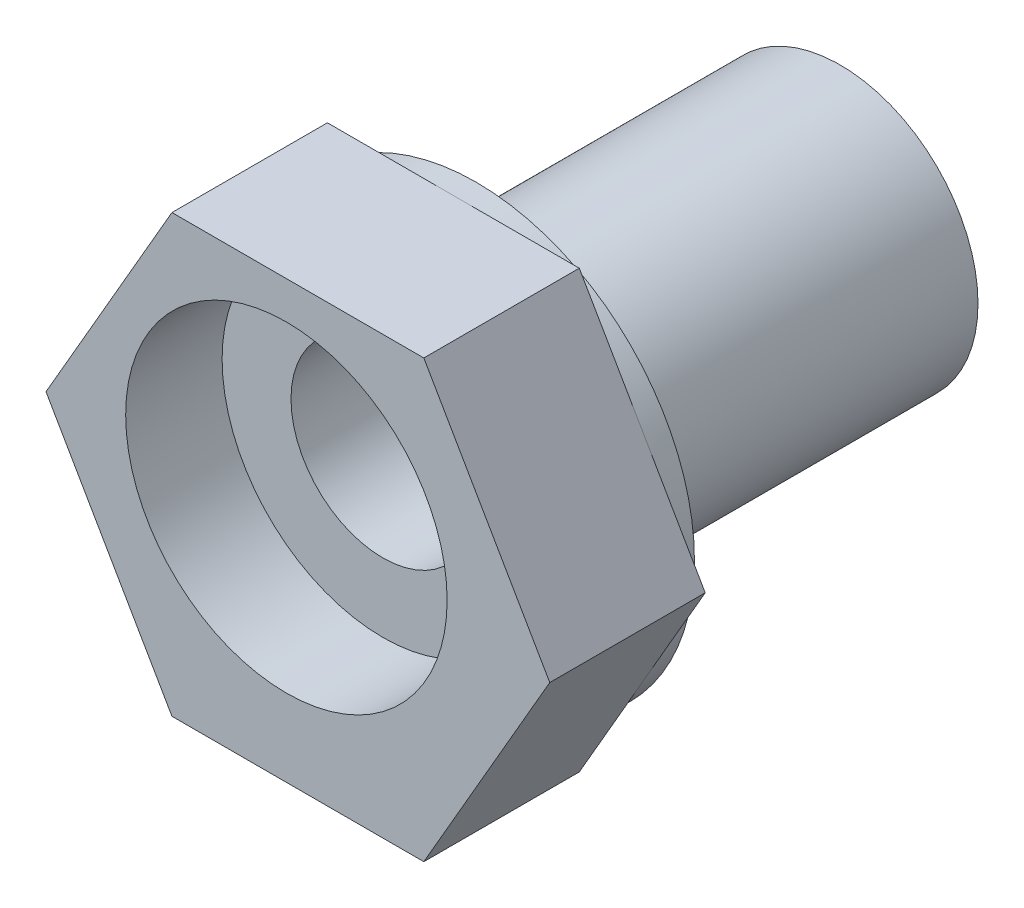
ISO-10303-21;
HEADER;
FILE_DESCRIPTION(('STEP AP214'),'2;1');
FILE_NAME('part.step','',(''),(''),'','','');
FILE_SCHEMA(('AUTOMOTIVE_DESIGN { 1 0 10303 214 1 1 1 1 }'));
ENDSEC;
DATA;
#1=APPLICATION_CONTEXT('core data for automotive mechanical design processes');
#2=APPLICATION_PROTOCOL_DEFINITION('international standard','automotive_design',2000,#1);
#3=PRODUCT_CONTEXT('',#1,'mechanical');
#4=PRODUCT('Part','Part','',(#3));
#5=PRODUCT_RELATED_PRODUCT_CATEGORY('part','',(#4));
#6=PRODUCT_DEFINITION_FORMATION('','',#4);
#7=PRODUCT_DEFINITION_CONTEXT('part definition',#1,'design');
#8=PRODUCT_DEFINITION('design','',#6,#7);
#9=PRODUCT_DEFINITION_SHAPE('','',#8);
#10=(LENGTH_UNIT() NAMED_UNIT(*) SI_UNIT(.MILLI.,.METRE.));
#11=(NAMED_UNIT(*) PLANE_ANGLE_UNIT() SI_UNIT($,.RADIAN.));
#12=(NAMED_UNIT(*) SI_UNIT($,.STERADIAN.) SOLID_ANGLE_UNIT());
#13=UNCERTAINTY_MEASURE_WITH_UNIT(LENGTH_MEASURE(1.E-05),#10,'distance_accuracy_value','');
#14=(GEOMETRIC_REPRESENTATION_CONTEXT(3) GLOBAL_UNCERTAINTY_ASSIGNED_CONTEXT((#13)) GLOBAL_UNIT_ASSIGNED_CONTEXT((#10,
#11,#12)) REPRESENTATION_CONTEXT('',''));
#15=CARTESIAN_POINT('',(0.,0.,0.));
#16=DIRECTION('',(0.,0.,1.));
#17=DIRECTION('',(1.,0.,0.));
#18=AXIS2_PLACEMENT_3D('',#15,#16,#17);
#19=CARTESIAN_POINT('',(0.,0.,23.62));
#20=DIRECTION('',(0.,0.,1.));
#21=DIRECTION('',(1.,0.,0.));
#22=AXIS2_PLACEMENT_3D('',#19,#20,#21);
#23=PLANE('',#22);
#24=CARTESIAN_POINT('',(-0.499999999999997,0.866025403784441,23.62));
#25=DIRECTION('',(0.,0.,-1.));
#26=DIRECTION('',(0.,1.,0.));
#27=AXIS2_PLACEMENT_3D('',#24,#25,#26);
#28=CIRCLE('',#27,7.);
#29=CARTESIAN_POINT('',(-0.499999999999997,7.86602540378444,23.62));
#30=VERTEX_POINT('',#29);
#31=EDGE_CURVE('E20',#30,#30,#28,.T.);
#32=ORIENTED_EDGE('',*,*,#31,.T.);
#33=EDGE_LOOP('',(#32));
#34=FACE_BOUND('',#33,.T.);
#35=DIRECTION('',(1.,0.,0.));
#36=VECTOR('',#35,1.);
#37=CARTESIAN_POINT('',(5.48482755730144,-9.5,23.62));
#38=LINE('',#37,#36);
#39=CARTESIAN_POINT('',(5.48482755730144,-9.5,23.62));
#40=VERTEX_POINT('',#39);
#41=CARTESIAN_POINT('',(-5.48482755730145,-9.5,23.62));
#42=VERTEX_POINT('',#41);
#43=EDGE_CURVE('E94',#40,#42,#38,.F.);
#44=ORIENTED_EDGE('',*,*,#43,.F.);
#45=DIRECTION('',(0.5,0.866025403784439,0.));
#46=VECTOR('',#45,1.);
#47=CARTESIAN_POINT('',(10.9696551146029,0.,23.62));
#48=LINE('',#47,#46);
#49=CARTESIAN_POINT('',(10.9696551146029,0.,23.62));
#50=VERTEX_POINT('',#49);
#51=EDGE_CURVE('E96',#50,#40,#48,.F.);
#52=ORIENTED_EDGE('',*,*,#51,.F.);
#53=DIRECTION('',(-0.499999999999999,0.866025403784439,0.));
#54=VECTOR('',#53,1.);
#55=CARTESIAN_POINT('',(5.48482755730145,9.5,23.62));
#56=LINE('',#55,#54);
#57=CARTESIAN_POINT('',(5.48482755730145,9.5,23.62));
#58=VERTEX_POINT('',#57);
#59=EDGE_CURVE('E123',#58,#50,#56,.F.);
#60=ORIENTED_EDGE('',*,*,#59,.F.);
#61=DIRECTION('',(1.,0.,0.));
#62=VECTOR('',#61,1.);
#63=CARTESIAN_POINT('',(-5.48482755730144,9.5,23.62));
#64=LINE('',#63,#62);
#65=CARTESIAN_POINT('',(-5.48482755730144,9.5,23.62));
#66=VERTEX_POINT('',#65);
#67=EDGE_CURVE('E122',#66,#58,#64,.T.);
#68=ORIENTED_EDGE('',*,*,#67,.F.);
#69=DIRECTION('',(-0.5,-0.866025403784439,0.));
#70=VECTOR('',#69,1.);
#71=CARTESIAN_POINT('',(-10.9696551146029,0.,23.62));
#72=LINE('',#71,#70);
#73=CARTESIAN_POINT('',(-10.9696551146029,0.,23.62));
#74=VERTEX_POINT('',#73);
#75=EDGE_CURVE('E124',#74,#66,#72,.F.);
#76=ORIENTED_EDGE('',*,*,#75,.F.);
#77=DIRECTION('',(0.5,-0.866025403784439,0.));
#78=VECTOR('',#77,1.);
#79=CARTESIAN_POINT('',(-5.48482755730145,-9.5,23.62));
#80=LINE('',#79,#78);
#81=EDGE_CURVE('E99',#42,#74,#80,.F.);
#82=ORIENTED_EDGE('',*,*,#81,.F.);
#83=EDGE_LOOP('',(#44,#52,#60,#68,#76,#82));
#84=FACE_BOUND('',#83,.T.);
#85=ADVANCED_FACE('F16',(#34,#84),#23,.T.);
#86=CARTESIAN_POINT('',(10.9696551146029,0.,16.85));
#87=DIRECTION('',(0.866025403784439,-0.5,0.));
#88=DIRECTION('',(0.5,0.866025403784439,0.));
#89=AXIS2_PLACEMENT_3D('',#86,#87,#88);
#90=PLANE('',#89);
#91=DIRECTION('',(0.5,0.866025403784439,0.));
#92=VECTOR('',#91,1.);
#93=CARTESIAN_POINT('',(8.22724133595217,-4.75,16.85));
#94=LINE('',#93,#92);
#95=CARTESIAN_POINT('',(8.22724133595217,-4.75,16.85));
#96=VERTEX_POINT('',#95);
#97=CARTESIAN_POINT('',(10.9696551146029,0.,16.85));
#98=VERTEX_POINT('',#97);
#99=EDGE_CURVE('E185',#96,#98,#94,.T.);
#100=ORIENTED_EDGE('',*,*,#99,.T.);
#101=DIRECTION('',(0.,0.,1.));
#102=VECTOR('',#101,1.);
#103=CARTESIAN_POINT('',(10.9696551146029,0.,16.85));
#104=LINE('',#103,#102);
#105=EDGE_CURVE('E108',#50,#98,#104,.F.);
#106=ORIENTED_EDGE('',*,*,#105,.F.);
#107=ORIENTED_EDGE('',*,*,#51,.T.);
#108=DIRECTION('',(0.,0.,-1.));
#109=VECTOR('',#108,1.);
#110=CARTESIAN_POINT('',(5.48482755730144,-9.5,16.85));
#111=LINE('',#110,#109);
#112=CARTESIAN_POINT('',(5.48482755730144,-9.5,16.85));
#113=VERTEX_POINT('',#112);
#114=EDGE_CURVE('E103',#113,#40,#111,.F.);
#115=ORIENTED_EDGE('',*,*,#114,.F.);
#116=DIRECTION('',(0.5,0.866025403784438,0.));
#117=VECTOR('',#116,1.);
#118=CARTESIAN_POINT('',(5.48482755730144,-9.5,16.85));
#119=LINE('',#118,#117);
#120=EDGE_CURVE('E181',#113,#96,#119,.T.);
#121=ORIENTED_EDGE('',*,*,#120,.T.);
#122=EDGE_LOOP('',(#100,#106,#107,#115,#121));
#123=FACE_BOUND('',#122,.T.);
#124=ADVANCED_FACE('F106',(#123),#90,.T.);
#125=CARTESIAN_POINT('',(5.48482755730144,-9.5,16.85));
#126=DIRECTION('',(0.,-1.,0.));
#127=DIRECTION('',(0.,0.,-1.));
#128=AXIS2_PLACEMENT_3D('',#125,#126,#127);
#129=PLANE('',#128);
#130=DIRECTION('',(1.,0.,0.));
#131=VECTOR('',#130,1.);
#132=CARTESIAN_POINT('',(0.,-9.5,16.85));
#133=LINE('',#132,#131);
#134=CARTESIAN_POINT('',(0.,-9.5,16.85));
#135=VERTEX_POINT('',#134);
#136=EDGE_CURVE('E113',#135,#113,#133,.T.);
#137=ORIENTED_EDGE('',*,*,#136,.T.);
#138=ORIENTED_EDGE('',*,*,#114,.T.);
#139=ORIENTED_EDGE('',*,*,#43,.T.);
#140=DIRECTION('',(0.,0.,1.));
#141=VECTOR('',#140,1.);
#142=CARTESIAN_POINT('',(-5.48482755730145,-9.5,16.85));
#143=LINE('',#142,#141);
#144=CARTESIAN_POINT('',(-5.48482755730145,-9.5,16.85));
#145=VERTEX_POINT('',#144);
#146=EDGE_CURVE('E116',#145,#42,#143,.T.);
#147=ORIENTED_EDGE('',*,*,#146,.F.);
#148=DIRECTION('',(1.,0.,0.));
#149=VECTOR('',#148,1.);
#150=CARTESIAN_POINT('',(0.,-9.5,16.85));
#151=LINE('',#150,#149);
#152=EDGE_CURVE('E176',#145,#135,#151,.T.);
#153=ORIENTED_EDGE('',*,*,#152,.T.);
#154=EDGE_LOOP('',(#137,#138,#139,#147,#153));
#155=FACE_BOUND('',#154,.T.);
#156=ADVANCED_FACE('F111',(#155),#129,.T.);
#157=CARTESIAN_POINT('',(-5.48482755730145,-9.5,16.85));
#158=DIRECTION('',(-0.866025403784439,-0.5,0.));
#159=DIRECTION('',(0.5,-0.866025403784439,0.));
#160=AXIS2_PLACEMENT_3D('',#157,#158,#159);
#161=PLANE('',#160);
#162=DIRECTION('',(0.5,-0.866025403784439,0.));
#163=VECTOR('',#162,1.);
#164=CARTESIAN_POINT('',(-8.22724133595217,-4.75,16.85));
#165=LINE('',#164,#163);
#166=CARTESIAN_POINT('',(-8.22724133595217,-4.74999999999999,16.85));
#167=VERTEX_POINT('',#166);
#168=EDGE_CURVE('E178',#167,#145,#165,.T.);
#169=ORIENTED_EDGE('',*,*,#168,.T.);
#170=ORIENTED_EDGE('',*,*,#146,.T.);
#171=ORIENTED_EDGE('',*,*,#81,.T.);
#172=DIRECTION('',(0.,0.,1.));
#173=VECTOR('',#172,1.);
#174=CARTESIAN_POINT('',(-10.9696551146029,0.,16.85));
#175=LINE('',#174,#173);
#176=CARTESIAN_POINT('',(-10.9696551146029,0.,16.85));
#177=VERTEX_POINT('',#176);
#178=EDGE_CURVE('E127',#177,#74,#175,.T.);
#179=ORIENTED_EDGE('',*,*,#178,.F.);
#180=DIRECTION('',(0.5,-0.866025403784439,0.));
#181=VECTOR('',#180,1.);
#182=CARTESIAN_POINT('',(-10.9696551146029,0.,16.85));
#183=LINE('',#182,#181);
#184=EDGE_CURVE('E171',#177,#167,#183,.T.);
#185=ORIENTED_EDGE('',*,*,#184,.T.);
#186=EDGE_LOOP('',(#169,#170,#171,#179,#185));
#187=FACE_BOUND('',#186,.T.);
#188=ADVANCED_FACE('F196',(#187),#161,.T.);
#189=CARTESIAN_POINT('',(-10.9696551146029,0.,16.85));
#190=DIRECTION('',(-0.866025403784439,0.5,0.));
#191=DIRECTION('',(-0.5,-0.866025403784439,0.));
#192=AXIS2_PLACEMENT_3D('',#189,#190,#191);
#193=PLANE('',#192);
#194=DIRECTION('',(-0.5,-0.866025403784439,0.));
#195=VECTOR('',#194,1.);
#196=CARTESIAN_POINT('',(-8.22724133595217,4.75,16.85));
#197=LINE('',#196,#195);
#198=CARTESIAN_POINT('',(-8.22724133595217,4.75,16.85));
#199=VERTEX_POINT('',#198);
#200=EDGE_CURVE('E173',#199,#177,#197,.T.);
#201=ORIENTED_EDGE('',*,*,#200,.T.);
#202=ORIENTED_EDGE('',*,*,#178,.T.);
#203=ORIENTED_EDGE('',*,*,#75,.T.);
#204=DIRECTION('',(0.,0.,1.));
#205=VECTOR('',#204,1.);
#206=CARTESIAN_POINT('',(-5.48482755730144,9.5,16.85));
#207=LINE('',#206,#205);
#208=CARTESIAN_POINT('',(-5.48482755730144,9.5,16.85));
#209=VERTEX_POINT('',#208);
#210=EDGE_CURVE('E188',#209,#66,#207,.T.);
#211=ORIENTED_EDGE('',*,*,#210,.F.);
#212=DIRECTION('',(-0.5,-0.866025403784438,0.));
#213=VECTOR('',#212,1.);
#214=CARTESIAN_POINT('',(-5.48482755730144,9.5,16.85));
#215=LINE('',#214,#213);
#216=EDGE_CURVE('E165',#209,#199,#215,.T.);
#217=ORIENTED_EDGE('',*,*,#216,.T.);
#218=EDGE_LOOP('',(#201,#202,#203,#211,#217));
#219=FACE_BOUND('',#218,.T.);
#220=ADVANCED_FACE('F192',(#219),#193,.T.);
#221=CARTESIAN_POINT('',(5.48482755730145,9.5,16.85));
#222=DIRECTION('',(0.866025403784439,0.499999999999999,0.));
#223=DIRECTION('',(-0.499999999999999,0.866025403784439,0.));
#224=AXIS2_PLACEMENT_3D('',#221,#222,#223);
#225=PLANE('',#224);
#226=DIRECTION('',(-0.499999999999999,0.866025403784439,0.));
#227=VECTOR('',#226,1.);
#228=CARTESIAN_POINT('',(8.22724133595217,4.74999999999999,16.85));
#229=LINE('',#228,#227);
#230=CARTESIAN_POINT('',(8.22724133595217,4.74999999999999,16.85));
#231=VERTEX_POINT('',#230);
#232=CARTESIAN_POINT('',(5.48482755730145,9.5,16.85));
#233=VERTEX_POINT('',#232);
#234=EDGE_CURVE('E62',#231,#233,#229,.T.);
#235=ORIENTED_EDGE('',*,*,#234,.T.);
#236=DIRECTION('',(0.,0.,1.));
#237=VECTOR('',#236,1.);
#238=CARTESIAN_POINT('',(5.48482755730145,9.5,16.85));
#239=LINE('',#238,#237);
#240=EDGE_CURVE('E130',#58,#233,#239,.F.);
#241=ORIENTED_EDGE('',*,*,#240,.F.);
#242=ORIENTED_EDGE('',*,*,#59,.T.);
#243=ORIENTED_EDGE('',*,*,#105,.T.);
#244=DIRECTION('',(-0.5,0.866025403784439,0.));
#245=VECTOR('',#244,1.);
#246=CARTESIAN_POINT('',(10.9696551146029,0.,16.85));
#247=LINE('',#246,#245);
#248=EDGE_CURVE('E55',#98,#231,#247,.T.);
#249=ORIENTED_EDGE('',*,*,#248,.T.);
#250=EDGE_LOOP('',(#235,#241,#242,#243,#249));
#251=FACE_BOUND('',#250,.T.);
#252=ADVANCED_FACE('F323',(#251),#225,.T.);
#253=CARTESIAN_POINT('',(-5.48482755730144,9.5,16.85));
#254=DIRECTION('',(0.,1.,0.));
#255=DIRECTION('',(0.,0.,1.));
#256=AXIS2_PLACEMENT_3D('',#253,#254,#255);
#257=PLANE('',#256);
#258=DIRECTION('',(1.,0.,0.));
#259=VECTOR('',#258,1.);
#260=CARTESIAN_POINT('',(0.,9.5,16.85));
#261=LINE('',#260,#259);
#262=CARTESIAN_POINT('',(0.,9.5,16.85));
#263=VERTEX_POINT('',#262);
#264=EDGE_CURVE('E169',#263,#209,#261,.F.);
#265=ORIENTED_EDGE('',*,*,#264,.T.);
#266=ORIENTED_EDGE('',*,*,#210,.T.);
#267=ORIENTED_EDGE('',*,*,#67,.T.);
#268=ORIENTED_EDGE('',*,*,#240,.T.);
#269=DIRECTION('',(1.,0.,0.));
#270=VECTOR('',#269,1.);
#271=CARTESIAN_POINT('',(0.,9.5,16.85));
#272=LINE('',#271,#270);
#273=EDGE_CURVE('E35',#233,#263,#272,.F.);
#274=ORIENTED_EDGE('',*,*,#273,.T.);
#275=EDGE_LOOP('',(#265,#266,#267,#268,#274));
#276=FACE_BOUND('',#275,.T.);
#277=ADVANCED_FACE('F218',(#276),#257,.T.);
#278=CARTESIAN_POINT('',(-0.499999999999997,0.866025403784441,23.62));
#279=DIRECTION('',(0.,0.,-1.));
#280=DIRECTION('',(0.,1.,0.));
#281=AXIS2_PLACEMENT_3D('',#278,#279,#280);
#282=CYLINDRICAL_SURFACE('',#281,7.);
#283=CARTESIAN_POINT('',(-0.499999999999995,0.866025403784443,19.42));
#284=DIRECTION('',(0.,0.,-1.));
#285=DIRECTION('',(0.,1.,0.));
#286=AXIS2_PLACEMENT_3D('',#283,#284,#285);
#287=CIRCLE('',#286,7.);
#288=CARTESIAN_POINT('',(-0.499999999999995,7.86602540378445,19.42));
#289=VERTEX_POINT('',#288);
#290=EDGE_CURVE('E160',#289,#289,#287,.T.);
#291=ORIENTED_EDGE('',*,*,#290,.T.);
#292=EDGE_LOOP('',(#291));
#293=FACE_BOUND('',#292,.T.);
#294=ORIENTED_EDGE('',*,*,#31,.F.);
#295=EDGE_LOOP('',(#294));
#296=FACE_BOUND('',#295,.T.);
#297=ADVANCED_FACE('F311',(#293,#296),#282,.F.);
#298=CARTESIAN_POINT('',(0.,0.,16.85));
#299=DIRECTION('',(0.,0.,1.));
#300=DIRECTION('',(1.,0.,0.));
#301=AXIS2_PLACEMENT_3D('',#298,#299,#300);
#302=PLANE('',#301);
#303=ORIENTED_EDGE('',*,*,#248,.F.);
#304=ORIENTED_EDGE('',*,*,#99,.F.);
#305=CARTESIAN_POINT('',(0.,0.,16.85));
#306=DIRECTION('',(0.,0.,1.));
#307=DIRECTION('',(1.,0.,0.));
#308=AXIS2_PLACEMENT_3D('',#305,#306,#307);
#309=CIRCLE('',#308,9.5);
#310=EDGE_CURVE('E158',#231,#96,#309,.F.);
#311=ORIENTED_EDGE('',*,*,#310,.F.);
#312=EDGE_LOOP('',(#303,#304,#311));
#313=FACE_BOUND('',#312,.T.);
#314=ADVANCED_FACE('F211',(#313),#302,.F.);
#315=CARTESIAN_POINT('',(0.,0.,16.85));
#316=DIRECTION('',(0.,0.,1.));
#317=DIRECTION('',(1.,0.,0.));
#318=AXIS2_PLACEMENT_3D('',#315,#316,#317);
#319=PLANE('',#318);
#320=ORIENTED_EDGE('',*,*,#120,.F.);
#321=ORIENTED_EDGE('',*,*,#136,.F.);
#322=CARTESIAN_POINT('',(0.,0.,16.85));
#323=DIRECTION('',(0.,0.,1.));
#324=DIRECTION('',(1.,0.,0.));
#325=AXIS2_PLACEMENT_3D('',#322,#323,#324);
#326=CIRCLE('',#325,9.5);
#327=EDGE_CURVE('E155',#96,#135,#326,.F.);
#328=ORIENTED_EDGE('',*,*,#327,.F.);
#329=EDGE_LOOP('',(#320,#321,#328));
#330=FACE_BOUND('',#329,.T.);
#331=ADVANCED_FACE('F203',(#330),#319,.F.);
#332=CARTESIAN_POINT('',(0.,0.,16.85));
#333=DIRECTION('',(0.,0.,1.));
#334=DIRECTION('',(1.,0.,0.));
#335=AXIS2_PLACEMENT_3D('',#332,#333,#334);
#336=PLANE('',#335);
#337=ORIENTED_EDGE('',*,*,#152,.F.);
#338=ORIENTED_EDGE('',*,*,#168,.F.);
#339=CARTESIAN_POINT('',(0.,0.,16.85));
#340=DIRECTION('',(0.,0.,1.));
#341=DIRECTION('',(1.,0.,0.));
#342=AXIS2_PLACEMENT_3D('',#339,#340,#341);
#343=CIRCLE('',#342,9.5);
#344=EDGE_CURVE('E152',#135,#167,#343,.F.);
#345=ORIENTED_EDGE('',*,*,#344,.F.);
#346=EDGE_LOOP('',(#337,#338,#345));
#347=FACE_BOUND('',#346,.T.);
#348=ADVANCED_FACE('F204',(#347),#336,.F.);
#349=CARTESIAN_POINT('',(0.,0.,16.85));
#350=DIRECTION('',(0.,0.,1.));
#351=DIRECTION('',(1.,0.,0.));
#352=AXIS2_PLACEMENT_3D('',#349,#350,#351);
#353=PLANE('',#352);
#354=ORIENTED_EDGE('',*,*,#184,.F.);
#355=ORIENTED_EDGE('',*,*,#200,.F.);
#356=CARTESIAN_POINT('',(0.,0.,16.85));
#357=DIRECTION('',(0.,0.,1.));
#358=DIRECTION('',(1.,0.,0.));
#359=AXIS2_PLACEMENT_3D('',#356,#357,#358);
#360=CIRCLE('',#359,9.5);
#361=EDGE_CURVE('E149',#167,#199,#360,.F.);
#362=ORIENTED_EDGE('',*,*,#361,.F.);
#363=EDGE_LOOP('',(#354,#355,#362));
#364=FACE_BOUND('',#363,.T.);
#365=ADVANCED_FACE('F220',(#364),#353,.F.);
#366=CARTESIAN_POINT('',(0.,0.,16.85));
#367=DIRECTION('',(0.,0.,1.));
#368=DIRECTION('',(1.,0.,0.));
#369=AXIS2_PLACEMENT_3D('',#366,#367,#368);
#370=PLANE('',#369);
#371=ORIENTED_EDGE('',*,*,#216,.F.);
#372=ORIENTED_EDGE('',*,*,#264,.F.);
#373=CARTESIAN_POINT('',(0.,0.,16.85));
#374=DIRECTION('',(0.,0.,1.));
#375=DIRECTION('',(1.,0.,0.));
#376=AXIS2_PLACEMENT_3D('',#373,#374,#375);
#377=CIRCLE('',#376,9.5);
#378=EDGE_CURVE('E146',#199,#263,#377,.F.);
#379=ORIENTED_EDGE('',*,*,#378,.F.);
#380=EDGE_LOOP('',(#371,#372,#379));
#381=FACE_BOUND('',#380,.T.);
#382=ADVANCED_FACE('F217',(#381),#370,.F.);
#383=CARTESIAN_POINT('',(0.,0.,16.85));
#384=DIRECTION('',(0.,0.,1.));
#385=DIRECTION('',(1.,0.,0.));
#386=AXIS2_PLACEMENT_3D('',#383,#384,#385);
#387=PLANE('',#386);
#388=ORIENTED_EDGE('',*,*,#273,.F.);
#389=ORIENTED_EDGE('',*,*,#234,.F.);
#390=CARTESIAN_POINT('',(0.,0.,16.85));
#391=DIRECTION('',(0.,0.,1.));
#392=DIRECTION('',(1.,0.,0.));
#393=AXIS2_PLACEMENT_3D('',#390,#391,#392);
#394=CIRCLE('',#393,9.5);
#395=EDGE_CURVE('E143',#263,#231,#394,.F.);
#396=ORIENTED_EDGE('',*,*,#395,.F.);
#397=EDGE_LOOP('',(#388,#389,#396));
#398=FACE_BOUND('',#397,.T.);
#399=ADVANCED_FACE('F213',(#398),#387,.F.);
#400=CARTESIAN_POINT('',(-7.64,8.00602540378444,19.42));
#401=DIRECTION('',(0.,0.,-1.));
#402=DIRECTION('',(1.,0.,0.));
#403=AXIS2_PLACEMENT_3D('',#400,#401,#402);
#404=PLANE('',#403);
#405=CARTESIAN_POINT('',(-0.499999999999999,0.866025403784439,19.42));
#406=DIRECTION('',(0.,0.,1.));
#407=DIRECTION('',(1.,0.,0.));
#408=AXIS2_PLACEMENT_3D('',#405,#406,#407);
#409=CIRCLE('',#408,4.);
#410=CARTESIAN_POINT('',(3.5,0.866025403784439,19.42));
#411=VERTEX_POINT('',#410);
#412=EDGE_CURVE('E140',#411,#411,#409,.F.);
#413=ORIENTED_EDGE('',*,*,#412,.T.);
#414=EDGE_LOOP('',(#413));
#415=FACE_BOUND('',#414,.T.);
#416=ORIENTED_EDGE('',*,*,#290,.F.);
#417=EDGE_LOOP('',(#416));
#418=FACE_BOUND('',#417,.T.);
#419=ADVANCED_FACE('F18',(#415,#418),#404,.F.);
#420=CARTESIAN_POINT('',(0.,0.,15.85));
#421=DIRECTION('',(0.,0.,1.));
#422=DIRECTION('',(1.,0.,0.));
#423=AXIS2_PLACEMENT_3D('',#420,#421,#422);
#424=CYLINDRICAL_SURFACE('',#423,9.5);
#425=CARTESIAN_POINT('',(0.,0.,15.85));
#426=DIRECTION('',(0.,0.,1.));
#427=DIRECTION('',(1.,0.,0.));
#428=AXIS2_PLACEMENT_3D('',#425,#426,#427);
#429=CIRCLE('',#428,9.5);
#430=CARTESIAN_POINT('',(9.5,0.,15.85));
#431=VERTEX_POINT('',#430);
#432=EDGE_CURVE('E137',#431,#431,#429,.F.);
#433=ORIENTED_EDGE('',*,*,#432,.F.);
#434=EDGE_LOOP('',(#433));
#435=FACE_BOUND('',#434,.T.);
#436=ORIENTED_EDGE('',*,*,#378,.T.);
#437=ORIENTED_EDGE('',*,*,#395,.T.);
#438=ORIENTED_EDGE('',*,*,#310,.T.);
#439=ORIENTED_EDGE('',*,*,#327,.T.);
#440=ORIENTED_EDGE('',*,*,#344,.T.);
#441=ORIENTED_EDGE('',*,*,#361,.T.);
#442=EDGE_LOOP('',(#436,#437,#438,#439,#440,#441));
#443=FACE_BOUND('',#442,.T.);
#444=ADVANCED_FACE('F207',(#435,#443),#424,.T.);
#445=CARTESIAN_POINT('',(-0.499999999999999,0.866025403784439,0.));
#446=DIRECTION('',(0.,0.,1.));
#447=DIRECTION('',(1.,0.,0.));
#448=AXIS2_PLACEMENT_3D('',#445,#446,#447);
#449=CYLINDRICAL_SURFACE('',#448,4.);
#450=CARTESIAN_POINT('',(-0.499999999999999,0.866025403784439,0.));
#451=DIRECTION('',(0.,0.,1.));
#452=DIRECTION('',(1.,0.,0.));
#453=AXIS2_PLACEMENT_3D('',#450,#451,#452);
#454=CIRCLE('',#453,4.);
#455=CARTESIAN_POINT('',(3.5,0.866025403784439,0.));
#456=VERTEX_POINT('',#455);
#457=EDGE_CURVE('E134',#456,#456,#454,.T.);
#458=ORIENTED_EDGE('',*,*,#457,.F.);
#459=EDGE_LOOP('',(#458));
#460=FACE_BOUND('',#459,.T.);
#461=ORIENTED_EDGE('',*,*,#412,.F.);
#462=EDGE_LOOP('',(#461));
#463=FACE_BOUND('',#462,.T.);
#464=ADVANCED_FACE('F245',(#460,#463),#449,.F.);
#465=CARTESIAN_POINT('',(0.,0.,15.85));
#466=DIRECTION('',(0.,0.,-1.));
#467=DIRECTION('',(-1.,0.,0.));
#468=AXIS2_PLACEMENT_3D('',#465,#466,#467);
#469=PLANE('',#468);
#470=CARTESIAN_POINT('',(0.,0.,15.85));
#471=DIRECTION('',(0.,0.,1.));
#472=DIRECTION('',(1.,0.,0.));
#473=AXIS2_PLACEMENT_3D('',#470,#471,#472);
#474=CIRCLE('',#473,6.);
#475=CARTESIAN_POINT('',(6.,0.,15.85));
#476=VERTEX_POINT('',#475);
#477=EDGE_CURVE('E26',#476,#476,#474,.F.);
#478=ORIENTED_EDGE('',*,*,#477,.F.);
#479=EDGE_LOOP('',(#478));
#480=FACE_BOUND('',#479,.T.);
#481=ORIENTED_EDGE('',*,*,#432,.T.);
#482=EDGE_LOOP('',(#481));
#483=FACE_BOUND('',#482,.T.);
#484=ADVANCED_FACE('F238',(#480,#483),#469,.T.);
#485=CARTESIAN_POINT('',(0.,0.,0.));
#486=DIRECTION('',(0.,0.,-1.));
#487=DIRECTION('',(-1.,0.,0.));
#488=AXIS2_PLACEMENT_3D('',#485,#486,#487);
#489=PLANE('',#488);
#490=ORIENTED_EDGE('',*,*,#457,.T.);
#491=EDGE_LOOP('',(#490));
#492=FACE_BOUND('',#491,.T.);
#493=CARTESIAN_POINT('',(0.,0.,0.));
#494=DIRECTION('',(0.,0.,1.));
#495=DIRECTION('',(1.,0.,0.));
#496=AXIS2_PLACEMENT_3D('',#493,#494,#495);
#497=CIRCLE('',#496,6.);
#498=CARTESIAN_POINT('',(6.,0.,0.));
#499=VERTEX_POINT('',#498);
#500=EDGE_CURVE('E11',#499,#499,#497,.T.);
#501=ORIENTED_EDGE('',*,*,#500,.F.);
#502=EDGE_LOOP('',(#501));
#503=FACE_BOUND('',#502,.T.);
#504=ADVANCED_FACE('F232',(#492,#503),#489,.T.);
#505=CARTESIAN_POINT('',(0.,0.,0.));
#506=DIRECTION('',(0.,0.,1.));
#507=DIRECTION('',(1.,0.,0.));
#508=AXIS2_PLACEMENT_3D('',#505,#506,#507);
#509=CYLINDRICAL_SURFACE('',#508,6.);
#510=ORIENTED_EDGE('',*,*,#500,.T.);
#511=EDGE_LOOP('',(#510));
#512=FACE_BOUND('',#511,.T.);
#513=ORIENTED_EDGE('',*,*,#477,.T.);
#514=EDGE_LOOP('',(#513));
#515=FACE_BOUND('',#514,.T.);
#516=ADVANCED_FACE('F230',(#512,#515),#509,.T.);
#517=CLOSED_SHELL('',(#85,#124,#156,#188,#220,#252,#277,#297,#314,#331,#348,#365,#382,#399,#419,
#444,#464,#484,#504,#516));
#518=MANIFOLD_SOLID_BREP('B1',#517);
#519=ADVANCED_BREP_SHAPE_REPRESENTATION('',(#18,#518),#14);
#520=SHAPE_DEFINITION_REPRESENTATION(#9,#519);
ENDSEC;
END-ISO-10303-21;
